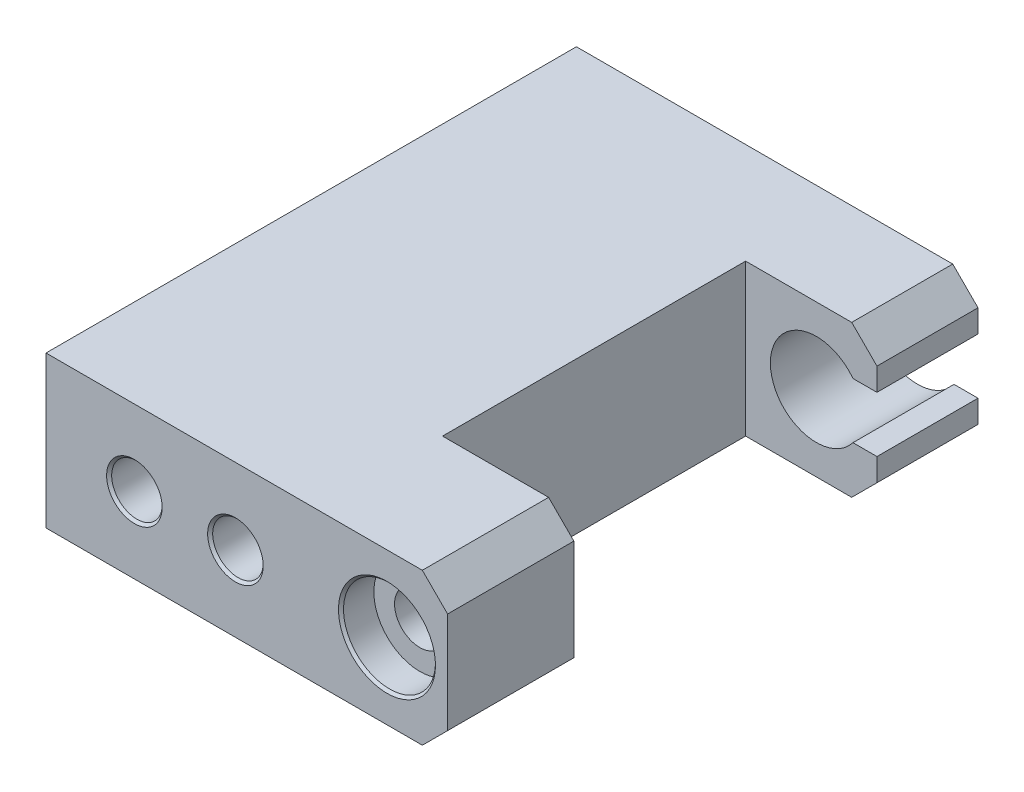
ISO-10303-21;
HEADER;
FILE_DESCRIPTION(('STEP AP214'),'2;1');
FILE_NAME('part.step','',(''),(''),'','','');
FILE_SCHEMA(('AUTOMOTIVE_DESIGN { 1 0 10303 214 1 1 1 1 }'));
ENDSEC;
DATA;
#1=APPLICATION_CONTEXT('core data for automotive mechanical design processes');
#2=APPLICATION_PROTOCOL_DEFINITION('international standard','automotive_design',2000,#1);
#3=PRODUCT_CONTEXT('',#1,'mechanical');
#4=PRODUCT('Part','Part','',(#3));
#5=PRODUCT_RELATED_PRODUCT_CATEGORY('part','',(#4));
#6=PRODUCT_DEFINITION_FORMATION('','',#4);
#7=PRODUCT_DEFINITION_CONTEXT('part definition',#1,'design');
#8=PRODUCT_DEFINITION('design','',#6,#7);
#9=PRODUCT_DEFINITION_SHAPE('','',#8);
#10=(LENGTH_UNIT() NAMED_UNIT(*) SI_UNIT(.MILLI.,.METRE.));
#11=(NAMED_UNIT(*) PLANE_ANGLE_UNIT() SI_UNIT($,.RADIAN.));
#12=(NAMED_UNIT(*) SI_UNIT($,.STERADIAN.) SOLID_ANGLE_UNIT());
#13=UNCERTAINTY_MEASURE_WITH_UNIT(LENGTH_MEASURE(1.E-05),#10,'distance_accuracy_value','');
#14=(GEOMETRIC_REPRESENTATION_CONTEXT(3) GLOBAL_UNCERTAINTY_ASSIGNED_CONTEXT((#13)) GLOBAL_UNIT_ASSIGNED_CONTEXT((#10,
#11,#12)) REPRESENTATION_CONTEXT('',''));
#15=CARTESIAN_POINT('',(0.,0.,0.));
#16=DIRECTION('',(0.,0.,1.));
#17=DIRECTION('',(1.,0.,0.));
#18=AXIS2_PLACEMENT_3D('',#15,#16,#17);
#19=CARTESIAN_POINT('',(0.,0.,105.));
#20=DIRECTION('',(0.,0.,1.));
#21=DIRECTION('',(1.,0.,0.));
#22=AXIS2_PLACEMENT_3D('',#19,#20,#21);
#23=PLANE('',#22);
#24=CARTESIAN_POINT('',(18.,15.,105.));
#25=DIRECTION('',(0.,0.,1.));
#26=DIRECTION('',(1.,0.,0.));
#27=AXIS2_PLACEMENT_3D('',#24,#25,#26);
#28=CIRCLE('',#27,5.5);
#29=CARTESIAN_POINT('',(23.5,15.,105.));
#30=VERTEX_POINT('',#29);
#31=EDGE_CURVE('E274',#30,#30,#28,.F.);
#32=ORIENTED_EDGE('',*,*,#31,.T.);
#33=EDGE_LOOP('',(#32));
#34=FACE_BOUND('',#33,.T.);
#35=CARTESIAN_POINT('',(38.,15.,105.));
#36=DIRECTION('',(0.,0.,1.));
#37=DIRECTION('',(1.,0.,0.));
#38=AXIS2_PLACEMENT_3D('',#35,#36,#37);
#39=CIRCLE('',#38,5.5);
#40=CARTESIAN_POINT('',(43.5,15.,105.));
#41=VERTEX_POINT('',#40);
#42=EDGE_CURVE('E271',#41,#41,#39,.F.);
#43=ORIENTED_EDGE('',*,*,#42,.T.);
#44=EDGE_LOOP('',(#43));
#45=FACE_BOUND('',#44,.T.);
#46=CARTESIAN_POINT('',(68.,15.,105.));
#47=DIRECTION('',(0.,0.,1.));
#48=DIRECTION('',(1.,0.,0.));
#49=AXIS2_PLACEMENT_3D('',#46,#47,#48);
#50=CIRCLE('',#49,9.6);
#51=CARTESIAN_POINT('',(77.6,15.,105.));
#52=VERTEX_POINT('',#51);
#53=EDGE_CURVE('E268',#52,#52,#50,.F.);
#54=ORIENTED_EDGE('',*,*,#53,.T.);
#55=EDGE_LOOP('',(#54));
#56=FACE_BOUND('',#55,.T.);
#57=DIRECTION('',(-1.,0.,0.));
#58=VECTOR('',#57,1.);
#59=CARTESIAN_POINT('',(80.,30.,105.));
#60=LINE('',#59,#58);
#61=CARTESIAN_POINT('',(75.,30.,105.));
#62=VERTEX_POINT('',#61);
#63=CARTESIAN_POINT('',(0.499999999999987,30.,105.));
#64=VERTEX_POINT('',#63);
#65=EDGE_CURVE('E225',#62,#64,#60,.T.);
#66=ORIENTED_EDGE('',*,*,#65,.T.);
#67=DIRECTION('',(0.,-1.,0.));
#68=VECTOR('',#67,1.);
#69=CARTESIAN_POINT('',(0.5,0.,105.));
#70=LINE('',#69,#68);
#71=CARTESIAN_POINT('',(0.5,0.,105.));
#72=VERTEX_POINT('',#71);
#73=EDGE_CURVE('E261',#64,#72,#70,.T.);
#74=ORIENTED_EDGE('',*,*,#73,.T.);
#75=DIRECTION('',(1.,0.,0.));
#76=VECTOR('',#75,1.);
#77=CARTESIAN_POINT('',(0.,0.,105.));
#78=LINE('',#77,#76);
#79=CARTESIAN_POINT('',(75.,0.,105.));
#80=VERTEX_POINT('',#79);
#81=EDGE_CURVE('E220',#72,#80,#78,.T.);
#82=ORIENTED_EDGE('',*,*,#81,.T.);
#83=DIRECTION('',(-0.707106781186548,-0.707106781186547,0.));
#84=VECTOR('',#83,1.);
#85=CARTESIAN_POINT('',(37.4999999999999,-37.5,105.));
#86=LINE('',#85,#84);
#87=CARTESIAN_POINT('',(80.,5.,105.));
#88=VERTEX_POINT('',#87);
#89=EDGE_CURVE('E246',#80,#88,#86,.F.);
#90=ORIENTED_EDGE('',*,*,#89,.T.);
#91=DIRECTION('',(0.,1.,0.));
#92=VECTOR('',#91,1.);
#93=CARTESIAN_POINT('',(80.,0.,105.));
#94=LINE('',#93,#92);
#95=CARTESIAN_POINT('',(80.,25.,105.));
#96=VERTEX_POINT('',#95);
#97=EDGE_CURVE('E222',#88,#96,#94,.T.);
#98=ORIENTED_EDGE('',*,*,#97,.T.);
#99=DIRECTION('',(0.707106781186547,-0.707106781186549,0.));
#100=VECTOR('',#99,1.);
#101=CARTESIAN_POINT('',(52.5000000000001,52.5,105.));
#102=LINE('',#101,#100);
#103=EDGE_CURVE('E248',#96,#62,#102,.F.);
#104=ORIENTED_EDGE('',*,*,#103,.T.);
#105=EDGE_LOOP('',(#66,#74,#82,#90,#98,#104));
#106=FACE_BOUND('',#105,.T.);
#107=ADVANCED_FACE('F29',(#34,#45,#56,#106),#23,.T.);
#108=CARTESIAN_POINT('',(54.,40.,80.));
#109=DIRECTION('',(0.,0.,-1.));
#110=DIRECTION('',(-1.,0.,0.));
#111=AXIS2_PLACEMENT_3D('',#108,#109,#110);
#112=PLANE('',#111);
#113=DIRECTION('',(1.,0.,0.));
#114=VECTOR('',#113,1.);
#115=CARTESIAN_POINT('',(80.,30.,80.));
#116=LINE('',#115,#114);
#117=CARTESIAN_POINT('',(54.,30.,80.));
#118=VERTEX_POINT('',#117);
#119=CARTESIAN_POINT('',(75.,30.,80.));
#120=VERTEX_POINT('',#119);
#121=EDGE_CURVE('E208',#118,#120,#116,.T.);
#122=ORIENTED_EDGE('',*,*,#121,.T.);
#123=DIRECTION('',(0.707106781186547,-0.707106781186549,0.));
#124=VECTOR('',#123,1.);
#125=CARTESIAN_POINT('',(75.,30.,80.));
#126=LINE('',#125,#124);
#127=CARTESIAN_POINT('',(80.,25.,80.));
#128=VERTEX_POINT('',#127);
#129=EDGE_CURVE('E205',#128,#120,#126,.F.);
#130=ORIENTED_EDGE('',*,*,#129,.F.);
#131=DIRECTION('',(0.,-1.,0.));
#132=VECTOR('',#131,1.);
#133=CARTESIAN_POINT('',(80.,0.,80.));
#134=LINE('',#133,#132);
#135=CARTESIAN_POINT('',(80.,5.00000000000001,80.));
#136=VERTEX_POINT('',#135);
#137=EDGE_CURVE('E201',#128,#136,#134,.T.);
#138=ORIENTED_EDGE('',*,*,#137,.T.);
#139=DIRECTION('',(-0.707106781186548,-0.707106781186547,0.));
#140=VECTOR('',#139,1.);
#141=CARTESIAN_POINT('',(80.,5.00000000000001,80.));
#142=LINE('',#141,#140);
#143=CARTESIAN_POINT('',(75.,0.,80.));
#144=VERTEX_POINT('',#143);
#145=EDGE_CURVE('E256',#144,#136,#142,.F.);
#146=ORIENTED_EDGE('',*,*,#145,.F.);
#147=DIRECTION('',(-1.,0.,0.));
#148=VECTOR('',#147,1.);
#149=CARTESIAN_POINT('',(0.,0.,80.));
#150=LINE('',#149,#148);
#151=CARTESIAN_POINT('',(54.,0.,80.));
#152=VERTEX_POINT('',#151);
#153=EDGE_CURVE('E203',#144,#152,#150,.T.);
#154=ORIENTED_EDGE('',*,*,#153,.T.);
#155=DIRECTION('',(0.,-1.,0.));
#156=VECTOR('',#155,1.);
#157=CARTESIAN_POINT('',(54.,40.,80.));
#158=LINE('',#157,#156);
#159=EDGE_CURVE('E182',#118,#152,#158,.T.);
#160=ORIENTED_EDGE('',*,*,#159,.F.);
#161=EDGE_LOOP('',(#122,#130,#138,#146,#154,#160));
#162=FACE_BOUND('',#161,.T.);
#163=CARTESIAN_POINT('',(68.,15.,80.));
#164=DIRECTION('',(0.,0.,-1.));
#165=DIRECTION('',(-1.,0.,0.));
#166=AXIS2_PLACEMENT_3D('',#163,#164,#165);
#167=CIRCLE('',#166,5.);
#168=CARTESIAN_POINT('',(63.,15.,80.));
#169=VERTEX_POINT('',#168);
#170=EDGE_CURVE('E265',#169,#169,#167,.T.);
#171=ORIENTED_EDGE('',*,*,#170,.F.);
#172=EDGE_LOOP('',(#171));
#173=FACE_BOUND('',#172,.T.);
#174=ADVANCED_FACE('F315',(#162,#173),#112,.T.);
#175=CARTESIAN_POINT('',(0.,0.,0.));
#176=DIRECTION('',(0.,0.,1.));
#177=DIRECTION('',(1.,0.,0.));
#178=AXIS2_PLACEMENT_3D('',#175,#176,#177);
#179=PLANE('',#178);
#180=DIRECTION('',(1.,0.,0.));
#181=VECTOR('',#180,1.);
#182=CARTESIAN_POINT('',(0.,0.,0.));
#183=LINE('',#182,#181);
#184=CARTESIAN_POINT('',(0.5,0.,0.));
#185=VERTEX_POINT('',#184);
#186=CARTESIAN_POINT('',(75.,0.,0.));
#187=VERTEX_POINT('',#186);
#188=EDGE_CURVE('E212',#185,#187,#183,.T.);
#189=ORIENTED_EDGE('',*,*,#188,.F.);
#190=DIRECTION('',(0.,1.,0.));
#191=VECTOR('',#190,1.);
#192=CARTESIAN_POINT('',(0.500000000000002,0.,0.));
#193=LINE('',#192,#191);
#194=CARTESIAN_POINT('',(0.5,30.,0.));
#195=VERTEX_POINT('',#194);
#196=EDGE_CURVE('E37',#185,#195,#193,.T.);
#197=ORIENTED_EDGE('',*,*,#196,.T.);
#198=DIRECTION('',(-1.,0.,0.));
#199=VECTOR('',#198,1.);
#200=CARTESIAN_POINT('',(80.,30.,0.));
#201=LINE('',#200,#199);
#202=CARTESIAN_POINT('',(75.,30.,0.));
#203=VERTEX_POINT('',#202);
#204=EDGE_CURVE('E218',#203,#195,#201,.T.);
#205=ORIENTED_EDGE('',*,*,#204,.F.);
#206=DIRECTION('',(-0.707106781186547,0.707106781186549,0.));
#207=VECTOR('',#206,1.);
#208=CARTESIAN_POINT('',(75.,30.,0.));
#209=LINE('',#208,#207);
#210=CARTESIAN_POINT('',(80.,25.,0.));
#211=VERTEX_POINT('',#210);
#212=EDGE_CURVE('E235',#203,#211,#209,.F.);
#213=ORIENTED_EDGE('',*,*,#212,.T.);
#214=DIRECTION('',(0.,1.,0.));
#215=VECTOR('',#214,1.);
#216=CARTESIAN_POINT('',(80.,0.,0.));
#217=LINE('',#216,#215);
#218=CARTESIAN_POINT('',(80.,20.5,0.));
#219=VERTEX_POINT('',#218);
#220=EDGE_CURVE('E214',#219,#211,#217,.T.);
#221=ORIENTED_EDGE('',*,*,#220,.F.);
#222=DIRECTION('',(-1.,0.,0.));
#223=VECTOR('',#222,1.);
#224=CARTESIAN_POINT('',(73.,20.5,0.));
#225=LINE('',#224,#223);
#226=CARTESIAN_POINT('',(75.2498275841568,20.5,0.));
#227=VERTEX_POINT('',#226);
#228=EDGE_CURVE('E340',#219,#227,#225,.T.);
#229=ORIENTED_EDGE('',*,*,#228,.T.);
#230=CARTESIAN_POINT('',(68.,15.,0.));
#231=DIRECTION('',(0.,0.,1.));
#232=DIRECTION('',(1.,0.,0.));
#233=AXIS2_PLACEMENT_3D('',#230,#231,#232);
#234=CIRCLE('',#233,9.1);
#235=CARTESIAN_POINT('',(75.2498275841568,9.5,0.));
#236=VERTEX_POINT('',#235);
#237=EDGE_CURVE('E179',#227,#236,#234,.T.);
#238=ORIENTED_EDGE('',*,*,#237,.T.);
#239=DIRECTION('',(1.,0.,0.));
#240=VECTOR('',#239,1.);
#241=CARTESIAN_POINT('',(73.,9.5,0.));
#242=LINE('',#241,#240);
#243=CARTESIAN_POINT('',(80.,9.5,0.));
#244=VERTEX_POINT('',#243);
#245=EDGE_CURVE('E158',#236,#244,#242,.T.);
#246=ORIENTED_EDGE('',*,*,#245,.T.);
#247=CARTESIAN_POINT('',(80.,5.00000000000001,0.));
#248=VERTEX_POINT('',#247);
#249=EDGE_CURVE('E215',#248,#244,#217,.T.);
#250=ORIENTED_EDGE('',*,*,#249,.F.);
#251=DIRECTION('',(0.707106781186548,0.707106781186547,0.));
#252=VECTOR('',#251,1.);
#253=CARTESIAN_POINT('',(80.,5.00000000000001,0.));
#254=LINE('',#253,#252);
#255=EDGE_CURVE('E232',#248,#187,#254,.F.);
#256=ORIENTED_EDGE('',*,*,#255,.T.);
#257=EDGE_LOOP('',(#189,#197,#205,#213,#221,#229,#238,#246,#250,#256));
#258=FACE_BOUND('',#257,.T.);
#259=ADVANCED_FACE('F352',(#258),#179,.F.);
#260=CARTESIAN_POINT('',(54.,40.,20.));
#261=DIRECTION('',(0.,0.,-1.));
#262=DIRECTION('',(-1.,0.,0.));
#263=AXIS2_PLACEMENT_3D('',#260,#261,#262);
#264=PLANE('',#263);
#265=DIRECTION('',(1.,0.,0.));
#266=VECTOR('',#265,1.);
#267=CARTESIAN_POINT('',(73.,20.5,20.));
#268=LINE('',#267,#266);
#269=CARTESIAN_POINT('',(75.2498275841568,20.5,20.));
#270=VERTEX_POINT('',#269);
#271=CARTESIAN_POINT('',(80.,20.5,20.));
#272=VERTEX_POINT('',#271);
#273=EDGE_CURVE('E184',#270,#272,#268,.T.);
#274=ORIENTED_EDGE('',*,*,#273,.T.);
#275=DIRECTION('',(0.,-1.,0.));
#276=VECTOR('',#275,1.);
#277=CARTESIAN_POINT('',(80.,0.,20.));
#278=LINE('',#277,#276);
#279=CARTESIAN_POINT('',(80.,25.,20.));
#280=VERTEX_POINT('',#279);
#281=EDGE_CURVE('E190',#280,#272,#278,.T.);
#282=ORIENTED_EDGE('',*,*,#281,.F.);
#283=DIRECTION('',(0.707106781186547,-0.707106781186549,0.));
#284=VECTOR('',#283,1.);
#285=CARTESIAN_POINT('',(75.,30.,20.));
#286=LINE('',#285,#284);
#287=CARTESIAN_POINT('',(75.,30.,20.));
#288=VERTEX_POINT('',#287);
#289=EDGE_CURVE('E196',#280,#288,#286,.F.);
#290=ORIENTED_EDGE('',*,*,#289,.T.);
#291=DIRECTION('',(1.,0.,0.));
#292=VECTOR('',#291,1.);
#293=CARTESIAN_POINT('',(80.,30.,20.));
#294=LINE('',#293,#292);
#295=CARTESIAN_POINT('',(54.,30.,20.));
#296=VERTEX_POINT('',#295);
#297=EDGE_CURVE('E198',#296,#288,#294,.T.);
#298=ORIENTED_EDGE('',*,*,#297,.F.);
#299=DIRECTION('',(0.,-1.,0.));
#300=VECTOR('',#299,1.);
#301=CARTESIAN_POINT('',(54.,40.,20.));
#302=LINE('',#301,#300);
#303=CARTESIAN_POINT('',(54.,0.,20.));
#304=VERTEX_POINT('',#303);
#305=EDGE_CURVE('E178',#296,#304,#302,.T.);
#306=ORIENTED_EDGE('',*,*,#305,.T.);
#307=DIRECTION('',(-1.,0.,0.));
#308=VECTOR('',#307,1.);
#309=CARTESIAN_POINT('',(0.,0.,20.));
#310=LINE('',#309,#308);
#311=CARTESIAN_POINT('',(75.,0.,20.));
#312=VERTEX_POINT('',#311);
#313=EDGE_CURVE('E193',#312,#304,#310,.T.);
#314=ORIENTED_EDGE('',*,*,#313,.F.);
#315=DIRECTION('',(-0.707106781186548,-0.707106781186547,0.));
#316=VECTOR('',#315,1.);
#317=CARTESIAN_POINT('',(80.,5.00000000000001,20.));
#318=LINE('',#317,#316);
#319=CARTESIAN_POINT('',(80.,5.00000000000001,20.));
#320=VERTEX_POINT('',#319);
#321=EDGE_CURVE('E254',#312,#320,#318,.F.);
#322=ORIENTED_EDGE('',*,*,#321,.T.);
#323=CARTESIAN_POINT('',(80.,9.5,20.));
#324=VERTEX_POINT('',#323);
#325=EDGE_CURVE('E173',#324,#320,#278,.T.);
#326=ORIENTED_EDGE('',*,*,#325,.F.);
#327=DIRECTION('',(-1.,0.,0.));
#328=VECTOR('',#327,1.);
#329=CARTESIAN_POINT('',(73.,9.5,20.));
#330=LINE('',#329,#328);
#331=CARTESIAN_POINT('',(75.2498275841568,9.5,20.));
#332=VERTEX_POINT('',#331);
#333=EDGE_CURVE('E155',#324,#332,#330,.T.);
#334=ORIENTED_EDGE('',*,*,#333,.T.);
#335=CARTESIAN_POINT('',(68.,15.,20.));
#336=DIRECTION('',(0.,0.,1.));
#337=DIRECTION('',(1.,0.,0.));
#338=AXIS2_PLACEMENT_3D('',#335,#336,#337);
#339=CIRCLE('',#338,9.1);
#340=EDGE_CURVE('E171',#270,#332,#339,.T.);
#341=ORIENTED_EDGE('',*,*,#340,.F.);
#342=EDGE_LOOP('',(#274,#282,#290,#298,#306,#314,#322,#326,#334,#341));
#343=FACE_BOUND('',#342,.T.);
#344=ADVANCED_FACE('F170',(#343),#264,.F.);
#345=CARTESIAN_POINT('',(80.,0.,105.));
#346=DIRECTION('',(-1.,0.,0.));
#347=DIRECTION('',(0.,0.,1.));
#348=AXIS2_PLACEMENT_3D('',#345,#346,#347);
#349=PLANE('',#348);
#350=DIRECTION('',(0.,0.,-1.));
#351=VECTOR('',#350,1.);
#352=CARTESIAN_POINT('',(80.,20.5,105.001));
#353=LINE('',#352,#351);
#354=EDGE_CURVE('E163',#272,#219,#353,.T.);
#355=ORIENTED_EDGE('',*,*,#354,.T.);
#356=ORIENTED_EDGE('',*,*,#220,.T.);
#357=DIRECTION('',(0.,0.,1.));
#358=VECTOR('',#357,1.);
#359=CARTESIAN_POINT('',(80.,25.,105.));
#360=LINE('',#359,#358);
#361=EDGE_CURVE('E243',#211,#280,#360,.T.);
#362=ORIENTED_EDGE('',*,*,#361,.T.);
#363=ORIENTED_EDGE('',*,*,#281,.T.);
#364=EDGE_LOOP('',(#355,#356,#362,#363));
#365=FACE_BOUND('',#364,.T.);
#366=ADVANCED_FACE('F345',(#365),#349,.F.);
#367=DIRECTION('',(0.,0.,1.));
#368=VECTOR('',#367,1.);
#369=CARTESIAN_POINT('',(80.,9.5,105.001));
#370=LINE('',#369,#368);
#371=EDGE_CURVE('E174',#244,#324,#370,.T.);
#372=ORIENTED_EDGE('',*,*,#371,.T.);
#373=ORIENTED_EDGE('',*,*,#325,.T.);
#374=DIRECTION('',(0.,0.,-1.));
#375=VECTOR('',#374,1.);
#376=CARTESIAN_POINT('',(80.,5.00000000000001,105.));
#377=LINE('',#376,#375);
#378=EDGE_CURVE('E238',#320,#248,#377,.T.);
#379=ORIENTED_EDGE('',*,*,#378,.T.);
#380=ORIENTED_EDGE('',*,*,#249,.T.);
#381=EDGE_LOOP('',(#372,#373,#379,#380));
#382=FACE_BOUND('',#381,.T.);
#383=ADVANCED_FACE('F334',(#382),#349,.F.);
#384=CARTESIAN_POINT('',(68.,15.,20.));
#385=DIRECTION('',(0.,0.,-1.));
#386=DIRECTION('',(-1.,0.,0.));
#387=AXIS2_PLACEMENT_3D('',#384,#385,#386);
#388=CYLINDRICAL_SURFACE('',#387,9.1);
#389=ORIENTED_EDGE('',*,*,#237,.F.);
#390=DIRECTION('',(0.,0.,-1.));
#391=VECTOR('',#390,1.);
#392=CARTESIAN_POINT('',(75.2498275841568,20.5,20.));
#393=LINE('',#392,#391);
#394=EDGE_CURVE('E164',#270,#227,#393,.T.);
#395=ORIENTED_EDGE('',*,*,#394,.F.);
#396=ORIENTED_EDGE('',*,*,#340,.T.);
#397=DIRECTION('',(0.,0.,-1.));
#398=VECTOR('',#397,1.);
#399=CARTESIAN_POINT('',(75.2498275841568,9.5,20.));
#400=LINE('',#399,#398);
#401=EDGE_CURVE('E152',#236,#332,#400,.F.);
#402=ORIENTED_EDGE('',*,*,#401,.F.);
#403=EDGE_LOOP('',(#389,#395,#396,#402));
#404=FACE_BOUND('',#403,.T.);
#405=ADVANCED_FACE('F177',(#404),#388,.F.);
#406=CARTESIAN_POINT('',(0.,0.,105.));
#407=DIRECTION('',(0.,1.,0.));
#408=DIRECTION('',(0.,0.,1.));
#409=AXIS2_PLACEMENT_3D('',#406,#407,#408);
#410=PLANE('',#409);
#411=ORIENTED_EDGE('',*,*,#81,.F.);
#412=DIRECTION('',(0.,0.,-1.));
#413=VECTOR('',#412,1.);
#414=CARTESIAN_POINT('',(0.5,0.,105.));
#415=LINE('',#414,#413);
#416=EDGE_CURVE('E11',#72,#185,#415,.T.);
#417=ORIENTED_EDGE('',*,*,#416,.T.);
#418=ORIENTED_EDGE('',*,*,#188,.T.);
#419=DIRECTION('',(0.,0.,1.));
#420=VECTOR('',#419,1.);
#421=CARTESIAN_POINT('',(75.,0.,105.));
#422=LINE('',#421,#420);
#423=EDGE_CURVE('E251',#187,#312,#422,.T.);
#424=ORIENTED_EDGE('',*,*,#423,.T.);
#425=ORIENTED_EDGE('',*,*,#313,.T.);
#426=DIRECTION('',(0.,0.,-1.));
#427=VECTOR('',#426,1.);
#428=CARTESIAN_POINT('',(54.,0.,105.));
#429=LINE('',#428,#427);
#430=EDGE_CURVE('E210',#152,#304,#429,.T.);
#431=ORIENTED_EDGE('',*,*,#430,.F.);
#432=ORIENTED_EDGE('',*,*,#153,.F.);
#433=EDGE_CURVE('E250',#144,#80,#422,.T.);
#434=ORIENTED_EDGE('',*,*,#433,.T.);
#435=EDGE_LOOP('',(#411,#417,#418,#424,#425,#431,#432,#434));
#436=FACE_BOUND('',#435,.T.);
#437=ADVANCED_FACE('F323',(#436),#410,.F.);
#438=ORIENTED_EDGE('',*,*,#137,.F.);
#439=EDGE_CURVE('E242',#128,#96,#360,.T.);
#440=ORIENTED_EDGE('',*,*,#439,.T.);
#441=ORIENTED_EDGE('',*,*,#97,.F.);
#442=EDGE_CURVE('E239',#88,#136,#377,.T.);
#443=ORIENTED_EDGE('',*,*,#442,.T.);
#444=EDGE_LOOP('',(#438,#440,#441,#443));
#445=FACE_BOUND('',#444,.T.);
#446=ADVANCED_FACE('F372',(#445),#349,.F.);
#447=CARTESIAN_POINT('',(80.,30.,105.));
#448=DIRECTION('',(0.,-1.,0.));
#449=DIRECTION('',(1.,0.,0.));
#450=AXIS2_PLACEMENT_3D('',#447,#448,#449);
#451=PLANE('',#450);
#452=ORIENTED_EDGE('',*,*,#204,.T.);
#453=DIRECTION('',(0.,0.,1.));
#454=VECTOR('',#453,1.);
#455=CARTESIAN_POINT('',(0.5,30.,105.));
#456=LINE('',#455,#454);
#457=EDGE_CURVE('E295',#195,#64,#456,.T.);
#458=ORIENTED_EDGE('',*,*,#457,.T.);
#459=ORIENTED_EDGE('',*,*,#65,.F.);
#460=DIRECTION('',(0.,0.,-1.));
#461=VECTOR('',#460,1.);
#462=CARTESIAN_POINT('',(75.,30.,105.));
#463=LINE('',#462,#461);
#464=EDGE_CURVE('E229',#62,#120,#463,.T.);
#465=ORIENTED_EDGE('',*,*,#464,.T.);
#466=ORIENTED_EDGE('',*,*,#121,.F.);
#467=DIRECTION('',(0.,0.,1.));
#468=VECTOR('',#467,1.);
#469=CARTESIAN_POINT('',(54.,30.,105.));
#470=LINE('',#469,#468);
#471=EDGE_CURVE('E259',#296,#118,#470,.T.);
#472=ORIENTED_EDGE('',*,*,#471,.F.);
#473=ORIENTED_EDGE('',*,*,#297,.T.);
#474=EDGE_CURVE('E228',#288,#203,#463,.T.);
#475=ORIENTED_EDGE('',*,*,#474,.T.);
#476=EDGE_LOOP('',(#452,#458,#459,#465,#466,#472,#473,#475));
#477=FACE_BOUND('',#476,.T.);
#478=ADVANCED_FACE('F300',(#477),#451,.F.);
#479=CARTESIAN_POINT('',(75.,30.,105.));
#480=DIRECTION('',(-0.707106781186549,-0.707106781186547,0.));
#481=DIRECTION('',(0.707106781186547,-0.707106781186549,0.));
#482=AXIS2_PLACEMENT_3D('',#479,#480,#481);
#483=PLANE('',#482);
#484=ORIENTED_EDGE('',*,*,#439,.F.);
#485=ORIENTED_EDGE('',*,*,#129,.T.);
#486=ORIENTED_EDGE('',*,*,#464,.F.);
#487=ORIENTED_EDGE('',*,*,#103,.F.);
#488=EDGE_LOOP('',(#484,#485,#486,#487));
#489=FACE_BOUND('',#488,.T.);
#490=ADVANCED_FACE('F310',(#489),#483,.F.);
#491=CARTESIAN_POINT('',(80.,5.00000000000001,105.));
#492=DIRECTION('',(-0.707106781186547,0.707106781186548,0.));
#493=DIRECTION('',(-0.707106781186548,-0.707106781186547,0.));
#494=AXIS2_PLACEMENT_3D('',#491,#492,#493);
#495=PLANE('',#494);
#496=ORIENTED_EDGE('',*,*,#433,.F.);
#497=ORIENTED_EDGE('',*,*,#145,.T.);
#498=ORIENTED_EDGE('',*,*,#442,.F.);
#499=ORIENTED_EDGE('',*,*,#89,.F.);
#500=EDGE_LOOP('',(#496,#497,#498,#499));
#501=FACE_BOUND('',#500,.T.);
#502=ADVANCED_FACE('F390',(#501),#495,.F.);
#503=CARTESIAN_POINT('',(0.,30.,105.));
#504=DIRECTION('',(1.,0.,0.));
#505=DIRECTION('',(0.,1.,0.));
#506=AXIS2_PLACEMENT_3D('',#503,#504,#505);
#507=PLANE('',#506);
#508=DIRECTION('',(0.,1.,0.));
#509=VECTOR('',#508,1.);
#510=CARTESIAN_POINT('',(0.,30.,104.5));
#511=LINE('',#510,#509);
#512=CARTESIAN_POINT('',(0.,0.5,104.5));
#513=VERTEX_POINT('',#512);
#514=CARTESIAN_POINT('',(0.,29.5,104.5));
#515=VERTEX_POINT('',#514);
#516=EDGE_CURVE('E290',#513,#515,#511,.T.);
#517=ORIENTED_EDGE('',*,*,#516,.T.);
#518=DIRECTION('',(0.,0.,-1.));
#519=VECTOR('',#518,1.);
#520=CARTESIAN_POINT('',(0.,29.5,105.));
#521=LINE('',#520,#519);
#522=CARTESIAN_POINT('',(0.,29.5,0.5));
#523=VERTEX_POINT('',#522);
#524=EDGE_CURVE('E292',#515,#523,#521,.T.);
#525=ORIENTED_EDGE('',*,*,#524,.T.);
#526=DIRECTION('',(0.,-1.,0.));
#527=VECTOR('',#526,1.);
#528=CARTESIAN_POINT('',(0.,30.,0.5));
#529=LINE('',#528,#527);
#530=CARTESIAN_POINT('',(0.,0.5,0.5));
#531=VERTEX_POINT('',#530);
#532=EDGE_CURVE('E288',#523,#531,#529,.T.);
#533=ORIENTED_EDGE('',*,*,#532,.T.);
#534=DIRECTION('',(0.,0.,1.));
#535=VECTOR('',#534,1.);
#536=CARTESIAN_POINT('',(0.,0.5,105.));
#537=LINE('',#536,#535);
#538=EDGE_CURVE('E286',#531,#513,#537,.T.);
#539=ORIENTED_EDGE('',*,*,#538,.T.);
#540=EDGE_LOOP('',(#517,#525,#533,#539));
#541=FACE_BOUND('',#540,.T.);
#542=ADVANCED_FACE('F31',(#541),#507,.F.);
#543=ORIENTED_EDGE('',*,*,#289,.F.);
#544=ORIENTED_EDGE('',*,*,#361,.F.);
#545=ORIENTED_EDGE('',*,*,#212,.F.);
#546=ORIENTED_EDGE('',*,*,#474,.F.);
#547=EDGE_LOOP('',(#543,#544,#545,#546));
#548=FACE_BOUND('',#547,.T.);
#549=ADVANCED_FACE('F350',(#548),#483,.F.);
#550=ORIENTED_EDGE('',*,*,#321,.F.);
#551=ORIENTED_EDGE('',*,*,#423,.F.);
#552=ORIENTED_EDGE('',*,*,#255,.F.);
#553=ORIENTED_EDGE('',*,*,#378,.F.);
#554=EDGE_LOOP('',(#550,#551,#552,#553));
#555=FACE_BOUND('',#554,.T.);
#556=ADVANCED_FACE('F330',(#555),#495,.F.);
#557=CARTESIAN_POINT('',(54.,40.,80.));
#558=DIRECTION('',(1.,0.,0.));
#559=DIRECTION('',(0.,1.,0.));
#560=AXIS2_PLACEMENT_3D('',#557,#558,#559);
#561=PLANE('',#560);
#562=ORIENTED_EDGE('',*,*,#430,.T.);
#563=ORIENTED_EDGE('',*,*,#305,.F.);
#564=ORIENTED_EDGE('',*,*,#471,.T.);
#565=ORIENTED_EDGE('',*,*,#159,.T.);
#566=EDGE_LOOP('',(#562,#563,#564,#565));
#567=FACE_BOUND('',#566,.T.);
#568=ADVANCED_FACE('F321',(#567),#561,.T.);
#569=CARTESIAN_POINT('',(73.,9.5,105.001));
#570=DIRECTION('',(0.,1.,0.));
#571=DIRECTION('',(0.,0.,1.));
#572=AXIS2_PLACEMENT_3D('',#569,#570,#571);
#573=PLANE('',#572);
#574=ORIENTED_EDGE('',*,*,#245,.F.);
#575=ORIENTED_EDGE('',*,*,#401,.T.);
#576=ORIENTED_EDGE('',*,*,#333,.F.);
#577=ORIENTED_EDGE('',*,*,#371,.F.);
#578=EDGE_LOOP('',(#574,#575,#576,#577));
#579=FACE_BOUND('',#578,.T.);
#580=ADVANCED_FACE('F154',(#579),#573,.T.);
#581=CARTESIAN_POINT('',(73.,20.5,105.001));
#582=DIRECTION('',(0.,-1.,0.));
#583=DIRECTION('',(0.,0.,-1.));
#584=AXIS2_PLACEMENT_3D('',#581,#582,#583);
#585=PLANE('',#584);
#586=ORIENTED_EDGE('',*,*,#273,.F.);
#587=ORIENTED_EDGE('',*,*,#394,.T.);
#588=ORIENTED_EDGE('',*,*,#228,.F.);
#589=ORIENTED_EDGE('',*,*,#354,.F.);
#590=EDGE_LOOP('',(#586,#587,#588,#589));
#591=FACE_BOUND('',#590,.T.);
#592=ADVANCED_FACE('F432',(#591),#585,.T.);
#593=CARTESIAN_POINT('',(68.,15.,-0.001000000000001));
#594=DIRECTION('',(0.,0.,1.));
#595=DIRECTION('',(1.,0.,0.));
#596=AXIS2_PLACEMENT_3D('',#593,#594,#595);
#597=CYLINDRICAL_SURFACE('',#596,5.);
#598=CARTESIAN_POINT('',(68.,15.,98.5));
#599=DIRECTION('',(0.,0.,-1.));
#600=DIRECTION('',(-1.,0.,0.));
#601=AXIS2_PLACEMENT_3D('',#598,#599,#600);
#602=CIRCLE('',#601,5.);
#603=CARTESIAN_POINT('',(63.,15.,98.5));
#604=VERTEX_POINT('',#603);
#605=EDGE_CURVE('E262',#604,#604,#602,.T.);
#606=ORIENTED_EDGE('',*,*,#605,.F.);
#607=EDGE_LOOP('',(#606));
#608=FACE_BOUND('',#607,.T.);
#609=ORIENTED_EDGE('',*,*,#170,.T.);
#610=EDGE_LOOP('',(#609));
#611=FACE_BOUND('',#610,.T.);
#612=ADVANCED_FACE('F434',(#608,#611),#597,.F.);
#613=CARTESIAN_POINT('',(68.,15.,98.5));
#614=DIRECTION('',(0.,0.,1.));
#615=DIRECTION('',(1.,0.,0.));
#616=AXIS2_PLACEMENT_3D('',#613,#614,#615);
#617=CYLINDRICAL_SURFACE('',#616,9.1);
#618=CARTESIAN_POINT('',(68.,15.,104.5));
#619=DIRECTION('',(0.,0.,1.));
#620=DIRECTION('',(1.,0.,0.));
#621=AXIS2_PLACEMENT_3D('',#618,#619,#620);
#622=CIRCLE('',#621,9.1);
#623=CARTESIAN_POINT('',(77.1,15.,104.5));
#624=VERTEX_POINT('',#623);
#625=EDGE_CURVE('E283',#624,#624,#622,.T.);
#626=CARTESIAN_POINT('',(68.,15.,98.5));
#627=DIRECTION('',(0.,0.,-1.));
#628=DIRECTION('',(-1.,0.,0.));
#629=AXIS2_PLACEMENT_3D('',#626,#627,#628);
#630=CIRCLE('',#629,9.1);
#631=CARTESIAN_POINT('',(77.1,15.,98.5));
#632=VERTEX_POINT('',#631);
#633=EDGE_CURVE('E266',#632,#632,#630,.T.);
#634=CARTESIAN_POINT('',(77.1,15.,104.5));
#635=CARTESIAN_POINT('',(77.1,15.,104.4375));
#636=CARTESIAN_POINT('',(77.1,15.,104.375));
#637=CARTESIAN_POINT('',(77.1,15.,104.25));
#638=CARTESIAN_POINT('',(77.1,15.,104.1875));
#639=CARTESIAN_POINT('',(77.1,15.,104.0625));
#640=CARTESIAN_POINT('',(77.1,15.,104.));
#641=CARTESIAN_POINT('',(77.1,15.,103.875));
#642=CARTESIAN_POINT('',(77.1,15.,103.8125));
#643=CARTESIAN_POINT('',(77.1,15.,103.6875));
#644=CARTESIAN_POINT('',(77.1,15.,103.625));
#645=CARTESIAN_POINT('',(77.1,15.,103.5));
#646=CARTESIAN_POINT('',(77.1,15.,103.4375));
#647=CARTESIAN_POINT('',(77.1,15.,103.3125));
#648=CARTESIAN_POINT('',(77.1,15.,103.25));
#649=CARTESIAN_POINT('',(77.1,15.,103.125));
#650=CARTESIAN_POINT('',(77.1,15.,103.0625));
#651=CARTESIAN_POINT('',(77.1,15.,102.9375));
#652=CARTESIAN_POINT('',(77.1,15.,102.875));
#653=CARTESIAN_POINT('',(77.1,15.,102.75));
#654=CARTESIAN_POINT('',(77.1,15.,102.6875));
#655=CARTESIAN_POINT('',(77.1,15.,102.5625));
#656=CARTESIAN_POINT('',(77.1,15.,102.5));
#657=CARTESIAN_POINT('',(77.1,15.,102.375));
#658=CARTESIAN_POINT('',(77.1,15.,102.3125));
#659=CARTESIAN_POINT('',(77.1,15.,102.1875));
#660=CARTESIAN_POINT('',(77.1,15.,102.125));
#661=CARTESIAN_POINT('',(77.1,15.,102.));
#662=CARTESIAN_POINT('',(77.1,15.,101.9375));
#663=CARTESIAN_POINT('',(77.1,15.,101.8125));
#664=CARTESIAN_POINT('',(77.1,15.,101.75));
#665=CARTESIAN_POINT('',(77.1,15.,101.625));
#666=CARTESIAN_POINT('',(77.1,15.,101.5625));
#667=CARTESIAN_POINT('',(77.1,15.,101.4375));
#668=CARTESIAN_POINT('',(77.1,15.,101.375));
#669=CARTESIAN_POINT('',(77.1,15.,101.25));
#670=CARTESIAN_POINT('',(77.1,15.,101.1875));
#671=CARTESIAN_POINT('',(77.1,15.,101.0625));
#672=CARTESIAN_POINT('',(77.1,15.,101.));
#673=CARTESIAN_POINT('',(77.1,15.,100.875));
#674=CARTESIAN_POINT('',(77.1,15.,100.8125));
#675=CARTESIAN_POINT('',(77.1,15.,100.6875));
#676=CARTESIAN_POINT('',(77.1,15.,100.625));
#677=CARTESIAN_POINT('',(77.1,15.,100.5));
#678=CARTESIAN_POINT('',(77.1,15.,100.4375));
#679=CARTESIAN_POINT('',(77.1,15.,100.3125));
#680=CARTESIAN_POINT('',(77.1,15.,100.25));
#681=CARTESIAN_POINT('',(77.1,15.,100.125));
#682=CARTESIAN_POINT('',(77.1,15.,100.0625));
#683=CARTESIAN_POINT('',(77.1,15.,99.9375));
#684=CARTESIAN_POINT('',(77.1,15.,99.875));
#685=CARTESIAN_POINT('',(77.1,15.,99.75));
#686=CARTESIAN_POINT('',(77.1,15.,99.6875));
#687=CARTESIAN_POINT('',(77.1,15.,99.5625));
#688=CARTESIAN_POINT('',(77.1,15.,99.5));
#689=CARTESIAN_POINT('',(77.1,15.,99.375));
#690=CARTESIAN_POINT('',(77.1,15.,99.3125));
#691=CARTESIAN_POINT('',(77.1,15.,99.1875));
#692=CARTESIAN_POINT('',(77.1,15.,99.125));
#693=CARTESIAN_POINT('',(77.1,15.,99.));
#694=CARTESIAN_POINT('',(77.1,15.,98.9375));
#695=CARTESIAN_POINT('',(77.1,15.,98.8125));
#696=CARTESIAN_POINT('',(77.1,15.,98.75));
#697=CARTESIAN_POINT('',(77.1,15.,98.625));
#698=CARTESIAN_POINT('',(77.1,15.,98.5625));
#699=CARTESIAN_POINT('',(77.1,15.,98.5));
#700=B_SPLINE_CURVE_WITH_KNOTS('',3,(#634,#635,#636,#637,#638,#639,#640,#641,#642,#643,#644,
#645,#646,#647,#648,#649,#650,#651,#652,#653,#654,#655,#656,#657,#658,#659,#660,#661,#662,#663,
#664,#665,#666,#667,#668,#669,#670,#671,#672,#673,#674,#675,#676,#677,#678,#679,#680,#681,#682,
#683,#684,#685,#686,#687,#688,#689,#690,#691,#692,#693,#694,#695,#696,#697,#698,#699),
.UNSPECIFIED.,.F.,.F.,(4,2,2,2,2,2,2,2,2,2,2,2,2,2,2,2,2,2,2,2,2,2,2,2,2,2,2,2,2,2,2,2,4),(0.,
0.187500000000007,0.375,0.562500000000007,0.750000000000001,0.937500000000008,1.125,
1.31250000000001,1.5,1.68750000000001,1.875,2.06250000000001,2.25,2.43750000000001,2.625,
2.81250000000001,3.,3.1875,3.375,3.5625,3.75,3.9375,4.125,4.3125,4.5,4.6875,4.875,5.0625,5.25,
5.4375,5.62500000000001,5.8125,6.00000000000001),.UNSPECIFIED.);
#701=EDGE_CURVE('BSEAM439',#624,#632,#700,.T.);
#702=ORIENTED_EDGE('',*,*,#625,.T.);
#703=ORIENTED_EDGE('',*,*,#633,.T.);
#704=ORIENTED_EDGE('',*,*,#701,.T.);
#705=ORIENTED_EDGE('',*,*,#701,.F.);
#706=EDGE_LOOP('',(#702,#704,#703,#705));
#707=FACE_BOUND('',#706,.T.);
#708=ADVANCED_FACE('F439',(#707),#617,.F.);
#709=CARTESIAN_POINT('',(68.,15.,98.5));
#710=DIRECTION('',(0.,0.,-1.));
#711=DIRECTION('',(-1.,0.,0.));
#712=AXIS2_PLACEMENT_3D('',#709,#710,#711);
#713=PLANE('',#712);
#714=ORIENTED_EDGE('',*,*,#605,.T.);
#715=EDGE_LOOP('',(#714));
#716=FACE_BOUND('',#715,.T.);
#717=ORIENTED_EDGE('',*,*,#633,.F.);
#718=EDGE_LOOP('',(#717));
#719=FACE_BOUND('',#718,.T.);
#720=ADVANCED_FACE('F445',(#716,#719),#713,.F.);
#721=CARTESIAN_POINT('',(38.,15.,75.));
#722=DIRECTION('',(0.,0.,1.));
#723=DIRECTION('',(1.,0.,0.));
#724=AXIS2_PLACEMENT_3D('',#721,#722,#723);
#725=CYLINDRICAL_SURFACE('',#724,5.);
#726=CARTESIAN_POINT('',(38.,15.,104.5));
#727=DIRECTION('',(0.,0.,1.));
#728=DIRECTION('',(1.,0.,0.));
#729=AXIS2_PLACEMENT_3D('',#726,#727,#728);
#730=CIRCLE('',#729,5.);
#731=CARTESIAN_POINT('',(43.,15.,104.5));
#732=VERTEX_POINT('',#731);
#733=EDGE_CURVE('E280',#732,#732,#730,.T.);
#734=ORIENTED_EDGE('',*,*,#733,.T.);
#735=EDGE_LOOP('',(#734));
#736=FACE_BOUND('',#735,.T.);
#737=CARTESIAN_POINT('',(38.,15.,75.));
#738=DIRECTION('',(0.,0.,-1.));
#739=DIRECTION('',(-1.,0.,0.));
#740=AXIS2_PLACEMENT_3D('',#737,#738,#739);
#741=CIRCLE('',#740,5.);
#742=CARTESIAN_POINT('',(33.,15.,75.));
#743=VERTEX_POINT('',#742);
#744=EDGE_CURVE('E420',#743,#743,#741,.T.);
#745=ORIENTED_EDGE('',*,*,#744,.T.);
#746=EDGE_LOOP('',(#745));
#747=FACE_BOUND('',#746,.T.);
#748=ADVANCED_FACE('F449',(#736,#747),#725,.F.);
#749=CARTESIAN_POINT('',(38.,15.,75.));
#750=DIRECTION('',(0.,0.,-1.));
#751=DIRECTION('',(-1.,0.,0.));
#752=AXIS2_PLACEMENT_3D('',#749,#750,#751);
#753=PLANE('',#752);
#754=ORIENTED_EDGE('',*,*,#744,.F.);
#755=EDGE_LOOP('',(#754));
#756=FACE_BOUND('',#755,.T.);
#757=ADVANCED_FACE('F453',(#756),#753,.F.);
#758=CARTESIAN_POINT('',(18.,15.,75.));
#759=DIRECTION('',(0.,0.,1.));
#760=DIRECTION('',(1.,0.,0.));
#761=AXIS2_PLACEMENT_3D('',#758,#759,#760);
#762=CYLINDRICAL_SURFACE('',#761,5.);
#763=CARTESIAN_POINT('',(18.,15.,104.5));
#764=DIRECTION('',(0.,0.,1.));
#765=DIRECTION('',(1.,0.,0.));
#766=AXIS2_PLACEMENT_3D('',#763,#764,#765);
#767=CIRCLE('',#766,5.);
#768=CARTESIAN_POINT('',(23.,15.,104.5));
#769=VERTEX_POINT('',#768);
#770=EDGE_CURVE('E277',#769,#769,#767,.T.);
#771=ORIENTED_EDGE('',*,*,#770,.T.);
#772=EDGE_LOOP('',(#771));
#773=FACE_BOUND('',#772,.T.);
#774=CARTESIAN_POINT('',(18.,15.,75.));
#775=DIRECTION('',(0.,0.,-1.));
#776=DIRECTION('',(-1.,0.,0.));
#777=AXIS2_PLACEMENT_3D('',#774,#775,#776);
#778=CIRCLE('',#777,5.);
#779=CARTESIAN_POINT('',(13.,15.,75.));
#780=VERTEX_POINT('',#779);
#781=EDGE_CURVE('E417',#780,#780,#778,.T.);
#782=ORIENTED_EDGE('',*,*,#781,.T.);
#783=EDGE_LOOP('',(#782));
#784=FACE_BOUND('',#783,.T.);
#785=ADVANCED_FACE('F457',(#773,#784),#762,.F.);
#786=CARTESIAN_POINT('',(18.,15.,75.));
#787=DIRECTION('',(0.,0.,-1.));
#788=DIRECTION('',(-1.,0.,0.));
#789=AXIS2_PLACEMENT_3D('',#786,#787,#788);
#790=PLANE('',#789);
#791=ORIENTED_EDGE('',*,*,#781,.F.);
#792=EDGE_LOOP('',(#791));
#793=FACE_BOUND('',#792,.T.);
#794=ADVANCED_FACE('F461',(#793),#790,.F.);
#795=CARTESIAN_POINT('',(18.,15.,105.));
#796=DIRECTION('',(0.,0.,1.));
#797=DIRECTION('',(1.,0.,0.));
#798=AXIS2_PLACEMENT_3D('',#795,#796,#797);
#799=CONICAL_SURFACE('',#798,5.5,0.785398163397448);
#800=ORIENTED_EDGE('',*,*,#770,.F.);
#801=EDGE_LOOP('',(#800));
#802=FACE_BOUND('',#801,.T.);
#803=ORIENTED_EDGE('',*,*,#31,.F.);
#804=EDGE_LOOP('',(#803));
#805=FACE_BOUND('',#804,.T.);
#806=ADVANCED_FACE('F465',(#802,#805),#799,.F.);
#807=CARTESIAN_POINT('',(38.,15.,105.));
#808=DIRECTION('',(0.,0.,1.));
#809=DIRECTION('',(1.,0.,0.));
#810=AXIS2_PLACEMENT_3D('',#807,#808,#809);
#811=CONICAL_SURFACE('',#810,5.5,0.785398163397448);
#812=ORIENTED_EDGE('',*,*,#733,.F.);
#813=EDGE_LOOP('',(#812));
#814=FACE_BOUND('',#813,.T.);
#815=ORIENTED_EDGE('',*,*,#42,.F.);
#816=EDGE_LOOP('',(#815));
#817=FACE_BOUND('',#816,.T.);
#818=ADVANCED_FACE('F469',(#814,#817),#811,.F.);
#819=CARTESIAN_POINT('',(68.,15.,105.));
#820=DIRECTION('',(0.,0.,1.));
#821=DIRECTION('',(1.,0.,0.));
#822=AXIS2_PLACEMENT_3D('',#819,#820,#821);
#823=CONICAL_SURFACE('',#822,9.6,0.785398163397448);
#824=ORIENTED_EDGE('',*,*,#625,.F.);
#825=EDGE_LOOP('',(#824));
#826=FACE_BOUND('',#825,.T.);
#827=ORIENTED_EDGE('',*,*,#53,.F.);
#828=EDGE_LOOP('',(#827));
#829=FACE_BOUND('',#828,.T.);
#830=ADVANCED_FACE('F473',(#826,#829),#823,.F.);
#831=CARTESIAN_POINT('',(0.5,0.,105.));
#832=DIRECTION('',(0.707106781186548,0.707106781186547,0.));
#833=DIRECTION('',(-0.707106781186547,0.707106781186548,0.));
#834=AXIS2_PLACEMENT_3D('',#831,#832,#833);
#835=PLANE('',#834);
#836=DIRECTION('',(0.577350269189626,-0.577350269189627,-0.577350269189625));
#837=VECTOR('',#836,1.);
#838=CARTESIAN_POINT('',(-34.5,35.,34.9999999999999));
#839=LINE('',#838,#837);
#840=EDGE_CURVE('E413',#185,#531,#839,.F.);
#841=ORIENTED_EDGE('',*,*,#840,.F.);
#842=ORIENTED_EDGE('',*,*,#416,.F.);
#843=DIRECTION('',(0.577350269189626,-0.577350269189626,0.577350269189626));
#844=VECTOR('',#843,1.);
#845=CARTESIAN_POINT('',(0.5,0.,105.));
#846=LINE('',#845,#844);
#847=EDGE_CURVE('E410',#513,#72,#846,.T.);
#848=ORIENTED_EDGE('',*,*,#847,.F.);
#849=ORIENTED_EDGE('',*,*,#538,.F.);
#850=EDGE_LOOP('',(#841,#842,#848,#849));
#851=FACE_BOUND('',#850,.T.);
#852=ADVANCED_FACE('F408',(#851),#835,.F.);
#853=CARTESIAN_POINT('',(0.5,0.,105.));
#854=DIRECTION('',(-0.707106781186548,0.,0.707106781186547));
#855=DIRECTION('',(0.707106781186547,0.,0.707106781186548));
#856=AXIS2_PLACEMENT_3D('',#853,#854,#855);
#857=PLANE('',#856);
#858=ORIENTED_EDGE('',*,*,#847,.T.);
#859=ORIENTED_EDGE('',*,*,#73,.F.);
#860=DIRECTION('',(0.577350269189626,0.577350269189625,0.577350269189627));
#861=VECTOR('',#860,1.);
#862=CARTESIAN_POINT('',(-9.49999999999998,20.,95.));
#863=LINE('',#862,#861);
#864=EDGE_CURVE('E422',#515,#64,#863,.T.);
#865=ORIENTED_EDGE('',*,*,#864,.F.);
#866=ORIENTED_EDGE('',*,*,#516,.F.);
#867=EDGE_LOOP('',(#858,#859,#865,#866));
#868=FACE_BOUND('',#867,.T.);
#869=ADVANCED_FACE('F415',(#868),#857,.T.);
#870=CARTESIAN_POINT('',(0.,30.,0.5));
#871=DIRECTION('',(0.707106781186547,0.,0.707106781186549));
#872=DIRECTION('',(0.707106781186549,0.,-0.707106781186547));
#873=AXIS2_PLACEMENT_3D('',#870,#871,#872);
#874=PLANE('',#873);
#875=ORIENTED_EDGE('',*,*,#840,.T.);
#876=ORIENTED_EDGE('',*,*,#532,.F.);
#877=DIRECTION('',(0.577350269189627,0.577350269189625,-0.577350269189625));
#878=VECTOR('',#877,1.);
#879=CARTESIAN_POINT('',(0.166666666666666,29.6666666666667,0.333333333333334));
#880=LINE('',#879,#878);
#881=EDGE_CURVE('E491',#195,#523,#880,.F.);
#882=ORIENTED_EDGE('',*,*,#881,.F.);
#883=ORIENTED_EDGE('',*,*,#196,.F.);
#884=EDGE_LOOP('',(#875,#876,#882,#883));
#885=FACE_BOUND('',#884,.T.);
#886=ADVANCED_FACE('F482',(#885),#874,.F.);
#887=CARTESIAN_POINT('',(0.,29.5,105.));
#888=DIRECTION('',(0.707106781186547,-0.707106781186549,0.));
#889=DIRECTION('',(0.707106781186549,0.707106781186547,0.));
#890=AXIS2_PLACEMENT_3D('',#887,#888,#889);
#891=PLANE('',#890);
#892=ORIENTED_EDGE('',*,*,#864,.T.);
#893=ORIENTED_EDGE('',*,*,#457,.F.);
#894=ORIENTED_EDGE('',*,*,#881,.T.);
#895=ORIENTED_EDGE('',*,*,#524,.F.);
#896=EDGE_LOOP('',(#892,#893,#894,#895));
#897=FACE_BOUND('',#896,.T.);
#898=ADVANCED_FACE('F485',(#897),#891,.F.);
#899=CLOSED_SHELL('',(#107,#174,#259,#344,#366,#383,#405,#437,#446,#478,#490,#502,#542,#549,
#556,#568,#580,#592,#612,#708,#720,#748,#757,#785,#794,#806,#818,#830,#852,#869,#886,#898));
#900=MANIFOLD_SOLID_BREP('B2',#899);
#901=ADVANCED_BREP_SHAPE_REPRESENTATION('',(#18,#900),#14);
#902=SHAPE_DEFINITION_REPRESENTATION(#9,#901);
ENDSEC;
END-ISO-10303-21;
